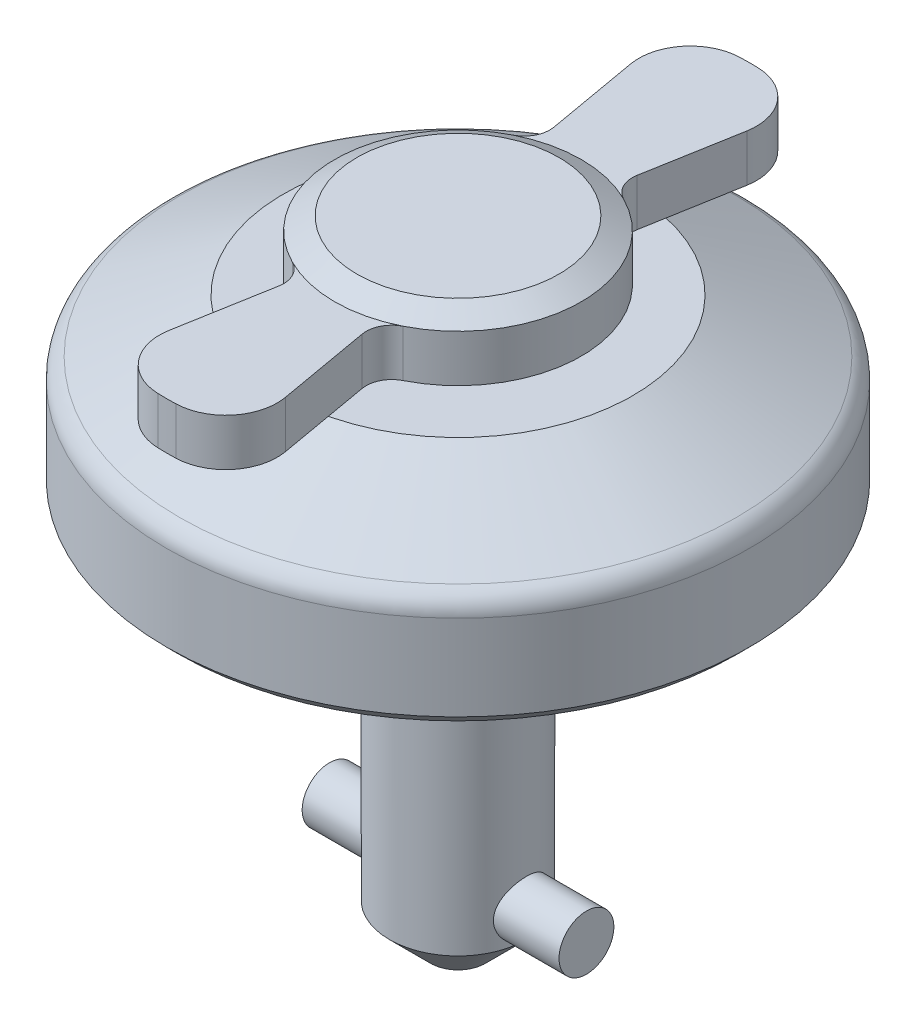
ISO-10303-21;
HEADER;
FILE_DESCRIPTION(('STEP AP214'),'2;1');
FILE_NAME('part.step','',(''),(''),'','','');
FILE_SCHEMA(('AUTOMOTIVE_DESIGN { 1 0 10303 214 1 1 1 1 }'));
ENDSEC;
DATA;
#1=APPLICATION_CONTEXT('core data for automotive mechanical design processes');
#2=APPLICATION_PROTOCOL_DEFINITION('international standard','automotive_design',2000,#1);
#3=PRODUCT_CONTEXT('',#1,'mechanical');
#4=PRODUCT('Part','Part','',(#3));
#5=PRODUCT_RELATED_PRODUCT_CATEGORY('part','',(#4));
#6=PRODUCT_DEFINITION_FORMATION('','',#4);
#7=PRODUCT_DEFINITION_CONTEXT('part definition',#1,'design');
#8=PRODUCT_DEFINITION('design','',#6,#7);
#9=PRODUCT_DEFINITION_SHAPE('','',#8);
#10=(LENGTH_UNIT() NAMED_UNIT(*) SI_UNIT(.MILLI.,.METRE.));
#11=(NAMED_UNIT(*) PLANE_ANGLE_UNIT() SI_UNIT($,.RADIAN.));
#12=(NAMED_UNIT(*) SI_UNIT($,.STERADIAN.) SOLID_ANGLE_UNIT());
#13=UNCERTAINTY_MEASURE_WITH_UNIT(LENGTH_MEASURE(1.E-05),#10,'distance_accuracy_value','');
#14=(GEOMETRIC_REPRESENTATION_CONTEXT(3) GLOBAL_UNCERTAINTY_ASSIGNED_CONTEXT((#13)) GLOBAL_UNIT_ASSIGNED_CONTEXT((#10,
#11,#12)) REPRESENTATION_CONTEXT('',''));
#15=CARTESIAN_POINT('',(0.,0.,0.));
#16=DIRECTION('',(0.,0.,1.));
#17=DIRECTION('',(1.,0.,0.));
#18=AXIS2_PLACEMENT_3D('',#15,#16,#17);
#19=CARTESIAN_POINT('',(0.,16.,0.));
#20=DIRECTION('',(0.,1.,0.));
#21=DIRECTION('',(0.,0.,1.));
#22=AXIS2_PLACEMENT_3D('',#19,#20,#21);
#23=CYLINDRICAL_SURFACE('',#22,7.2);
#24=CARTESIAN_POINT('',(0.,18.75,0.));
#25=DIRECTION('',(0.,1.,0.));
#26=DIRECTION('',(0.,0.,1.));
#27=AXIS2_PLACEMENT_3D('',#24,#25,#26);
#28=CIRCLE('',#27,7.2);
#29=CARTESIAN_POINT('',(-3.23506859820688,18.75,6.43228817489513));
#30=VERTEX_POINT('',#29);
#31=CARTESIAN_POINT('',(-3.23506859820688,18.75,-6.43228817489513));
#32=VERTEX_POINT('',#31);
#33=EDGE_CURVE('P0_E325',#30,#32,#28,.F.);
#34=ORIENTED_EDGE('',*,*,#33,.T.);
#35=DIRECTION('',(0.,1.,0.));
#36=VECTOR('',#35,1.);
#37=CARTESIAN_POINT('',(-3.23506859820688,16.,-6.43228817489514));
#38=LINE('',#37,#36);
#39=CARTESIAN_POINT('',(-3.23506859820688,16.,-6.43228817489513));
#40=VERTEX_POINT('',#39);
#41=EDGE_CURVE('P0_E242',#32,#40,#38,.F.);
#42=ORIENTED_EDGE('',*,*,#41,.T.);
#43=CARTESIAN_POINT('',(0.,16.,0.));
#44=DIRECTION('',(0.,1.,0.));
#45=DIRECTION('',(0.,0.,1.));
#46=AXIS2_PLACEMENT_3D('',#43,#44,#45);
#47=CIRCLE('',#46,7.2);
#48=CARTESIAN_POINT('',(-3.23506859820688,16.,6.43228817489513));
#49=VERTEX_POINT('',#48);
#50=EDGE_CURVE('P0_E222',#40,#49,#47,.T.);
#51=ORIENTED_EDGE('',*,*,#50,.T.);
#52=DIRECTION('',(0.,1.,0.));
#53=VECTOR('',#52,1.);
#54=CARTESIAN_POINT('',(-3.23506859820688,16.,6.43228817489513));
#55=LINE('',#54,#53);
#56=EDGE_CURVE('P0_E234',#49,#30,#55,.T.);
#57=ORIENTED_EDGE('',*,*,#56,.T.);
#58=EDGE_LOOP('',(#34,#42,#51,#57));
#59=FACE_BOUND('',#58,.T.);
#60=ADVANCED_FACE('P0_F16',(#59),#23,.T.);
#61=CARTESIAN_POINT('',(0.,-17.5,0.));
#62=DIRECTION('',(0.,-1.,0.));
#63=DIRECTION('',(0.,0.,-1.));
#64=AXIS2_PLACEMENT_3D('',#61,#62,#63);
#65=CYLINDRICAL_SURFACE('',#64,3.2);
#66=CARTESIAN_POINT('',(0.,0.,0.));
#67=DIRECTION('',(0.,-1.,0.));
#68=DIRECTION('',(0.,0.,-1.));
#69=AXIS2_PLACEMENT_3D('',#66,#67,#68);
#70=CIRCLE('',#69,3.2);
#71=CARTESIAN_POINT('',(0.,0.,-3.2));
#72=VERTEX_POINT('',#71);
#73=EDGE_CURVE('P0_E146',#72,#72,#70,.T.);
#74=ORIENTED_EDGE('',*,*,#73,.F.);
#75=EDGE_LOOP('',(#74));
#76=FACE_BOUND('',#75,.T.);
#77=CARTESIAN_POINT('',(0.,16.,0.));
#78=DIRECTION('',(0.,1.,0.));
#79=DIRECTION('',(0.,0.,1.));
#80=AXIS2_PLACEMENT_3D('',#77,#78,#79);
#81=CIRCLE('',#80,3.2);
#82=CARTESIAN_POINT('',(0.,16.,3.2));
#83=VERTEX_POINT('',#82);
#84=EDGE_CURVE('P0_E271',#83,#83,#81,.F.);
#85=ORIENTED_EDGE('',*,*,#84,.T.);
#86=EDGE_LOOP('',(#85));
#87=FACE_BOUND('',#86,.T.);
#88=ADVANCED_FACE('P0_F184',(#76,#87),#65,.T.);
#89=CARTESIAN_POINT('',(0.,-17.5,0.));
#90=DIRECTION('',(0.,-1.,0.));
#91=DIRECTION('',(0.,0.,-1.));
#92=AXIS2_PLACEMENT_3D('',#89,#90,#91);
#93=PLANE('',#92);
#94=CARTESIAN_POINT('',(0.,-17.5,0.));
#95=DIRECTION('',(0.,-1.,0.));
#96=DIRECTION('',(0.,0.,-1.));
#97=AXIS2_PLACEMENT_3D('',#94,#95,#96);
#98=CIRCLE('',#97,1.6);
#99=CARTESIAN_POINT('',(0.,-17.5,-1.6));
#100=VERTEX_POINT('',#99);
#101=EDGE_CURVE('P0_E137',#100,#100,#98,.T.);
#102=ORIENTED_EDGE('',*,*,#101,.T.);
#103=EDGE_LOOP('',(#102));
#104=FACE_BOUND('',#103,.T.);
#105=ADVANCED_FACE('P0_F186',(#104),#93,.T.);
#106=CARTESIAN_POINT('',(0.,-17.5,0.));
#107=DIRECTION('',(0.,1.,0.));
#108=DIRECTION('',(0.,0.,1.));
#109=AXIS2_PLACEMENT_3D('',#106,#107,#108);
#110=CONICAL_SURFACE('',#109,1.6,0.78539816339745);
#111=CARTESIAN_POINT('',(0.,-15.1,0.));
#112=DIRECTION('',(0.,-1.,0.));
#113=DIRECTION('',(0.,0.,-1.));
#114=AXIS2_PLACEMENT_3D('',#111,#112,#113);
#115=CIRCLE('',#114,4.);
#116=CARTESIAN_POINT('',(4.00000000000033,-15.1000000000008,0.));
#117=VERTEX_POINT('',#116);
#118=CARTESIAN_POINT('',(-4.,-15.1,0.));
#119=VERTEX_POINT('',#118);
#120=EDGE_CURVE('P0_E129',#117,#119,#115,.T.);
#121=ORIENTED_EDGE('',*,*,#120,.T.);
#122=EDGE_CURVE('P0_E133',#119,#117,#115,.T.);
#123=ORIENTED_EDGE('',*,*,#122,.T.);
#124=EDGE_LOOP('',(#121,#123));
#125=FACE_BOUND('',#124,.T.);
#126=ORIENTED_EDGE('',*,*,#101,.F.);
#127=EDGE_LOOP('',(#126));
#128=FACE_BOUND('',#127,.T.);
#129=ADVANCED_FACE('P0_F131',(#125,#128),#110,.T.);
#130=CARTESIAN_POINT('',(0.,-17.5,0.));
#131=DIRECTION('',(0.,-1.,0.));
#132=DIRECTION('',(0.,0.,-1.));
#133=AXIS2_PLACEMENT_3D('',#130,#131,#132);
#134=CYLINDRICAL_SURFACE('',#133,4.);
#135=CARTESIAN_POINT('',(0.,0.,0.));
#136=DIRECTION('',(0.,-1.,0.));
#137=DIRECTION('',(0.,0.,-1.));
#138=AXIS2_PLACEMENT_3D('',#135,#136,#137);
#139=CIRCLE('',#138,4.);
#140=CARTESIAN_POINT('',(0.,0.,-4.));
#141=VERTEX_POINT('',#140);
#142=EDGE_CURVE('P0_E144',#141,#141,#139,.T.);
#143=ORIENTED_EDGE('',*,*,#142,.T.);
#144=EDGE_LOOP('',(#143));
#145=FACE_BOUND('',#144,.T.);
#146=ORIENTED_EDGE('',*,*,#120,.F.);
#147=CARTESIAN_POINT('',(3.66606055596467,-13.5,1.6));
#148=CARTESIAN_POINT('',(3.66606921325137,-13.5857115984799,1.59999060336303));
#149=CARTESIAN_POINT('',(3.66910881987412,-13.6715444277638,1.59307185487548));
#150=CARTESIAN_POINT('',(3.68088731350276,-13.8407478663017,1.56565522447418));
#151=CARTESIAN_POINT('',(3.68964076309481,-13.9241116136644,1.5451226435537));
#152=CARTESIAN_POINT('',(3.71168364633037,-14.0856423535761,1.49138802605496));
#153=CARTESIAN_POINT('',(3.72495597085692,-14.1638276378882,1.45823372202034));
#154=CARTESIAN_POINT('',(3.75451732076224,-14.3135080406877,1.38033621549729));
#155=CARTESIAN_POINT('',(3.77080568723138,-14.3850046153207,1.335595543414));
#156=CARTESIAN_POINT('',(3.80560692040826,-14.5234083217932,1.23305757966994));
#157=CARTESIAN_POINT('',(3.82419134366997,-14.5898851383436,1.17470348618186));
#158=CARTESIAN_POINT('',(3.86089965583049,-14.7124231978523,1.04776728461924));
#159=CARTESIAN_POINT('',(3.87902338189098,-14.7684808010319,0.979181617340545));
#160=CARTESIAN_POINT('',(3.91362726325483,-14.8707251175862,0.830405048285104));
#161=CARTESIAN_POINT('',(3.93001442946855,-14.9164354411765,0.749863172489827));
#162=CARTESIAN_POINT('',(3.95843142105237,-14.9934748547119,0.581460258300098));
#163=CARTESIAN_POINT('',(3.97046301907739,-15.0248097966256,0.493602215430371));
#164=CARTESIAN_POINT('',(3.98830660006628,-15.0706731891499,0.317573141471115));
#165=CARTESIAN_POINT('',(3.99439149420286,-15.0859418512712,0.229623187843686));
#166=CARTESIAN_POINT('',(4.00064248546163,-15.1016227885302,0.0522130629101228));
#167=CARTESIAN_POINT('',(4.0008107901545,-15.1020406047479,-0.0372465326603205));
#168=CARTESIAN_POINT('',(3.99537570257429,-15.08841378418,-0.209785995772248));
#169=CARTESIAN_POINT('',(3.99009597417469,-15.0751801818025,-0.292941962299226));
#170=CARTESIAN_POINT('',(3.97479433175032,-15.0360056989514,-0.45573848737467));
#171=CARTESIAN_POINT('',(3.9647720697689,-15.0100638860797,-0.535378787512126));
#172=CARTESIAN_POINT('',(3.9407745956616,-14.945890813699,-0.690318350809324));
#173=CARTESIAN_POINT('',(3.9267420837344,-14.9074802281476,-0.765534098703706));
#174=CARTESIAN_POINT('',(3.89611668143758,-14.8196279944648,-0.908646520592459));
#175=CARTESIAN_POINT('',(3.87952291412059,-14.7701825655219,-0.976540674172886));
#176=CARTESIAN_POINT('',(3.84417309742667,-14.6578806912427,-1.10781506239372));
#177=CARTESIAN_POINT('',(3.82534661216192,-14.5943568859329,-1.17060627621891));
#178=CARTESIAN_POINT('',(3.78849328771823,-14.4576075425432,-1.28488593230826));
#179=CARTESIAN_POINT('',(3.77046671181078,-14.3843788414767,-1.33637067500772));
#180=CARTESIAN_POINT('',(3.7367751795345,-14.2276647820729,-1.42792335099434));
#181=CARTESIAN_POINT('',(3.72119131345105,-14.143948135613,-1.46762772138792));
#182=CARTESIAN_POINT('',(3.69510072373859,-13.9702276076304,-1.53214100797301));
#183=CARTESIAN_POINT('',(3.68459070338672,-13.8802278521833,-1.55695959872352));
#184=CARTESIAN_POINT('',(3.67063807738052,-13.7023713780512,-1.58956395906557));
#185=CARTESIAN_POINT('',(3.6668029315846,-13.6147196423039,-1.59829767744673));
#186=CARTESIAN_POINT('',(3.66551598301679,-13.4391382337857,-1.60124906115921));
#187=CARTESIAN_POINT('',(3.6680622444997,-13.3512086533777,-1.59547112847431));
#188=CARTESIAN_POINT('',(3.67884835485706,-13.1828328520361,-1.57042631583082));
#189=CARTESIAN_POINT('',(3.68675566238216,-13.1022456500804,-1.55194644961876));
#190=CARTESIAN_POINT('',(3.70696040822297,-12.9453692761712,-1.50304334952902));
#191=CARTESIAN_POINT('',(3.71925881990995,-12.8690810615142,-1.47261746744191));
#192=CARTESIAN_POINT('',(3.7474702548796,-12.7195181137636,-1.39930851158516));
#193=CARTESIAN_POINT('',(3.76350963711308,-12.6464910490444,-1.35597029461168));
#194=CARTESIAN_POINT('',(3.7972030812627,-12.5084136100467,-1.2585321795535));
#195=CARTESIAN_POINT('',(3.8148577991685,-12.4433665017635,-1.20442789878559));
#196=CARTESIAN_POINT('',(3.85136732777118,-12.3181012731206,-1.08227536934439));
#197=CARTESIAN_POINT('',(3.87021445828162,-12.2585947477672,-1.01349234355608));
#198=CARTESIAN_POINT('',(3.9057583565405,-12.1518583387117,-0.866466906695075));
#199=CARTESIAN_POINT('',(3.92245503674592,-12.1046289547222,-0.788224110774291));
#200=CARTESIAN_POINT('',(3.95186972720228,-12.023961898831,-0.624223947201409));
#201=CARTESIAN_POINT('',(3.96458868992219,-11.9905209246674,-0.538468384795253));
#202=CARTESIAN_POINT('',(3.98458170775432,-11.9387609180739,-0.36191487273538));
#203=CARTESIAN_POINT('',(3.99185871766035,-11.920433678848,-0.271119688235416));
#204=CARTESIAN_POINT('',(3.9998320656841,-11.9003962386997,-0.0934532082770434));
#205=CARTESIAN_POINT('',(4.00092677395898,-11.8976798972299,-0.00671239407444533));
#206=CARTESIAN_POINT('',(3.99748833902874,-11.9062843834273,0.165947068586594));
#207=CARTESIAN_POINT('',(3.9929560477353,-11.9176030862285,0.251865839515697));
#208=CARTESIAN_POINT('',(3.97897210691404,-11.9532374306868,0.417736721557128));
#209=CARTESIAN_POINT('',(3.96967584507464,-11.9771431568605,0.497791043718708));
#210=CARTESIAN_POINT('',(3.9471595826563,-12.0368422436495,0.652737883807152));
#211=CARTESIAN_POINT('',(3.93393885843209,-12.0726377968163,0.72762944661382));
#212=CARTESIAN_POINT('',(3.90414475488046,-12.1568825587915,0.873762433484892));
#213=CARTESIAN_POINT('',(3.88744903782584,-12.2058210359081,0.94469630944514));
#214=CARTESIAN_POINT('',(3.85271522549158,-12.3142308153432,1.07764322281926));
#215=CARTESIAN_POINT('',(3.834676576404,-12.3737064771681,1.1396525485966));
#216=CARTESIAN_POINT('',(3.79790210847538,-12.50585217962,1.25696101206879));
#217=CARTESIAN_POINT('',(3.77919226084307,-12.5791110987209,1.31160710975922));
#218=CARTESIAN_POINT('',(3.74439737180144,-12.734353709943,1.40787796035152));
#219=CARTESIAN_POINT('',(3.72831263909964,-12.8163384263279,1.44950118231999));
#220=CARTESIAN_POINT('',(3.70207091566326,-12.9792297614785,1.51519287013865));
#221=CARTESIAN_POINT('',(3.69151134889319,-13.059572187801,1.54050201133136));
#222=CARTESIAN_POINT('',(3.67556802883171,-13.2235883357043,1.57817420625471));
#223=CARTESIAN_POINT('',(3.6701698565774,-13.3072520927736,1.59057333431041));
#224=CARTESIAN_POINT('',(3.66659567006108,-13.4275020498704,1.59877140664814));
#225=CARTESIAN_POINT('',(3.66605689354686,-13.4637401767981,1.6000039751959));
#226=CARTESIAN_POINT('',(3.66606055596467,-13.5,1.6));
#227=B_SPLINE_CURVE_WITH_KNOTS('',3,(#147,#148,#149,#150,#151,#152,#153,#154,#155,#156,#157,
#158,#159,#160,#161,#162,#163,#164,#165,#166,#167,#168,#169,#170,#171,#172,#173,#174,#175,#176,
#177,#178,#179,#180,#181,#182,#183,#184,#185,#186,#187,#188,#189,#190,#191,#192,#193,#194,#195,
#196,#197,#198,#199,#200,#201,#202,#203,#204,#205,#206,#207,#208,#209,#210,#211,#212,#213,#214,
#215,#216,#217,#218,#219,#220,#221,#222,#223,#224,#225,#226),.UNSPECIFIED.,.T.,.F.,(4,2,2,2,2,2,
2,2,2,2,2,2,2,2,2,2,2,2,2,2,2,2,2,2,2,2,2,2,2,2,2,2,2,2,2,2,2,2,2,4),(0.,0.257022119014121,
0.514701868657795,0.771416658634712,1.02807543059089,1.2980449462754,1.56810859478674,
1.84882135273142,2.12941973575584,2.39643346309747,2.66334756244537,2.91526915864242,
3.16720924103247,3.42294640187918,3.67877131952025,3.95139235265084,4.22410245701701,
4.50451566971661,4.78474643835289,5.04785718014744,5.31088811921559,5.55893798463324,
5.80704286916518,6.06520923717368,6.32348091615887,6.60082987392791,6.87819011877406,
7.15548389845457,7.43262700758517,7.6916883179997,7.95071041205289,8.20177595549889,
8.45288782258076,8.71509640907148,8.97741373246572,9.25597002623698,9.53455905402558,
9.78813328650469,10.040997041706,10.1497288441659),.UNSPECIFIED.);
#228=EDGE_CURVE('P0_E143',#117,#117,#227,.T.);
#229=ORIENTED_EDGE('',*,*,#228,.F.);
#230=ORIENTED_EDGE('',*,*,#122,.F.);
#231=CARTESIAN_POINT('',(-3.66606055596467,-13.5,1.6));
#232=CARTESIAN_POINT('',(-3.66606921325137,-13.4142884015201,1.59999060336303));
#233=CARTESIAN_POINT('',(-3.66910881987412,-13.3284555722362,1.59307185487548));
#234=CARTESIAN_POINT('',(-3.68088731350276,-13.1592521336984,1.56565522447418));
#235=CARTESIAN_POINT('',(-3.68964076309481,-13.0758883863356,1.5451226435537));
#236=CARTESIAN_POINT('',(-3.71168364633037,-12.914357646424,1.49138802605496));
#237=CARTESIAN_POINT('',(-3.72495597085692,-12.8361723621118,1.45823372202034));
#238=CARTESIAN_POINT('',(-3.75451732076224,-12.6864919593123,1.38033621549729));
#239=CARTESIAN_POINT('',(-3.77080568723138,-12.6149953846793,1.335595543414));
#240=CARTESIAN_POINT('',(-3.80560692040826,-12.4765916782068,1.23305757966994));
#241=CARTESIAN_POINT('',(-3.82419134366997,-12.4101148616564,1.17470348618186));
#242=CARTESIAN_POINT('',(-3.86089965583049,-12.2875768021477,1.04776728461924));
#243=CARTESIAN_POINT('',(-3.87902338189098,-12.2315191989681,0.979181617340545));
#244=CARTESIAN_POINT('',(-3.91362726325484,-12.1292748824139,0.830405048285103));
#245=CARTESIAN_POINT('',(-3.93001442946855,-12.0835645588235,0.749863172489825));
#246=CARTESIAN_POINT('',(-3.95843142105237,-12.0065251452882,0.581460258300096));
#247=CARTESIAN_POINT('',(-3.97046301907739,-11.9751902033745,0.49360221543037));
#248=CARTESIAN_POINT('',(-3.98830660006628,-11.9293268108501,0.317573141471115));
#249=CARTESIAN_POINT('',(-3.99439149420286,-11.9140581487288,0.229623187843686));
#250=CARTESIAN_POINT('',(-4.00064248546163,-11.8983772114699,0.0522130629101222));
#251=CARTESIAN_POINT('',(-4.0008107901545,-11.8979593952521,-0.0372465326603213));
#252=CARTESIAN_POINT('',(-3.99537570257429,-11.91158621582,-0.209785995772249));
#253=CARTESIAN_POINT('',(-3.99009597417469,-11.9248198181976,-0.292941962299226));
#254=CARTESIAN_POINT('',(-3.97479433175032,-11.9639943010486,-0.45573848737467));
#255=CARTESIAN_POINT('',(-3.9647720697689,-11.9899361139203,-0.535378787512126));
#256=CARTESIAN_POINT('',(-3.9407745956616,-12.0541091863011,-0.690318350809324));
#257=CARTESIAN_POINT('',(-3.9267420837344,-12.0925197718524,-0.765534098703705));
#258=CARTESIAN_POINT('',(-3.89611668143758,-12.1803720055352,-0.908646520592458));
#259=CARTESIAN_POINT('',(-3.87952291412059,-12.2298174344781,-0.976540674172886));
#260=CARTESIAN_POINT('',(-3.84417309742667,-12.3421193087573,-1.10781506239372));
#261=CARTESIAN_POINT('',(-3.82534661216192,-12.4056431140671,-1.17060627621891));
#262=CARTESIAN_POINT('',(-3.78849328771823,-12.5423924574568,-1.28488593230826));
#263=CARTESIAN_POINT('',(-3.77046671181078,-12.6156211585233,-1.33637067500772));
#264=CARTESIAN_POINT('',(-3.7367751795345,-12.7723352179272,-1.42792335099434));
#265=CARTESIAN_POINT('',(-3.72119131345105,-12.8560518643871,-1.46762772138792));
#266=CARTESIAN_POINT('',(-3.69510072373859,-13.0297723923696,-1.53214100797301));
#267=CARTESIAN_POINT('',(-3.68459070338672,-13.1197721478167,-1.55695959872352));
#268=CARTESIAN_POINT('',(-3.67063807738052,-13.2976286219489,-1.58956395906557));
#269=CARTESIAN_POINT('',(-3.6668029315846,-13.3852803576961,-1.59829767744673));
#270=CARTESIAN_POINT('',(-3.66551598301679,-13.5608617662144,-1.60124906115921));
#271=CARTESIAN_POINT('',(-3.6680622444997,-13.6487913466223,-1.59547112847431));
#272=CARTESIAN_POINT('',(-3.67884835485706,-13.8171671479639,-1.57042631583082));
#273=CARTESIAN_POINT('',(-3.68675566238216,-13.8977543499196,-1.55194644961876));
#274=CARTESIAN_POINT('',(-3.70696040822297,-14.0546307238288,-1.50304334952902));
#275=CARTESIAN_POINT('',(-3.71925881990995,-14.1309189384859,-1.47261746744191));
#276=CARTESIAN_POINT('',(-3.7474702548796,-14.2804818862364,-1.39930851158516));
#277=CARTESIAN_POINT('',(-3.76350963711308,-14.3535089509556,-1.35597029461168));
#278=CARTESIAN_POINT('',(-3.7972030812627,-14.4915863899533,-1.2585321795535));
#279=CARTESIAN_POINT('',(-3.8148577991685,-14.5566334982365,-1.20442789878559));
#280=CARTESIAN_POINT('',(-3.85136732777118,-14.6818987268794,-1.08227536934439));
#281=CARTESIAN_POINT('',(-3.87021445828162,-14.7414052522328,-1.01349234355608));
#282=CARTESIAN_POINT('',(-3.9057583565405,-14.8481416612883,-0.866466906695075));
#283=CARTESIAN_POINT('',(-3.92245503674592,-14.8953710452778,-0.788224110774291));
#284=CARTESIAN_POINT('',(-3.95186972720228,-14.976038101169,-0.624223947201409));
#285=CARTESIAN_POINT('',(-3.96458868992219,-15.0094790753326,-0.538468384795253));
#286=CARTESIAN_POINT('',(-3.98458170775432,-15.0612390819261,-0.361914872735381));
#287=CARTESIAN_POINT('',(-3.99185871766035,-15.0795663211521,-0.271119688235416));
#288=CARTESIAN_POINT('',(-3.9998320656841,-15.0996037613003,-0.093453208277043));
#289=CARTESIAN_POINT('',(-4.00092677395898,-15.1023201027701,-0.0067123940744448));
#290=CARTESIAN_POINT('',(-3.99748833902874,-15.0937156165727,0.165947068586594));
#291=CARTESIAN_POINT('',(-3.9929560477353,-15.0823969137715,0.251865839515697));
#292=CARTESIAN_POINT('',(-3.97897210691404,-15.0467625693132,0.417736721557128));
#293=CARTESIAN_POINT('',(-3.96967584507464,-15.0228568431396,0.497791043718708));
#294=CARTESIAN_POINT('',(-3.9471595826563,-14.9631577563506,0.652737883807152));
#295=CARTESIAN_POINT('',(-3.93393885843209,-14.9273622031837,0.72762944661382));
#296=CARTESIAN_POINT('',(-3.90414475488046,-14.8431174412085,0.873762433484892));
#297=CARTESIAN_POINT('',(-3.88744903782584,-14.7941789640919,0.94469630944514));
#298=CARTESIAN_POINT('',(-3.85271522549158,-14.6857691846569,1.07764322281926));
#299=CARTESIAN_POINT('',(-3.834676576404,-14.6262935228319,1.1396525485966));
#300=CARTESIAN_POINT('',(-3.79790210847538,-14.49414782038,1.25696101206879));
#301=CARTESIAN_POINT('',(-3.77919226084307,-14.4208889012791,1.31160710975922));
#302=CARTESIAN_POINT('',(-3.74439737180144,-14.265646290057,1.40787796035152));
#303=CARTESIAN_POINT('',(-3.72831263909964,-14.1836615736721,1.44950118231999));
#304=CARTESIAN_POINT('',(-3.70207091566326,-14.0207702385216,1.51519287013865));
#305=CARTESIAN_POINT('',(-3.69151134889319,-13.9404278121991,1.54050201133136));
#306=CARTESIAN_POINT('',(-3.67556802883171,-13.7764116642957,1.57817420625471));
#307=CARTESIAN_POINT('',(-3.6701698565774,-13.6927479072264,1.59057333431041));
#308=CARTESIAN_POINT('',(-3.66659567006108,-13.5724979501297,1.59877140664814));
#309=CARTESIAN_POINT('',(-3.66605689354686,-13.5362598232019,1.6000039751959));
#310=CARTESIAN_POINT('',(-3.66606055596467,-13.5,1.6));
#311=B_SPLINE_CURVE_WITH_KNOTS('',3,(#231,#232,#233,#234,#235,#236,#237,#238,#239,#240,#241,
#242,#243,#244,#245,#246,#247,#248,#249,#250,#251,#252,#253,#254,#255,#256,#257,#258,#259,#260,
#261,#262,#263,#264,#265,#266,#267,#268,#269,#270,#271,#272,#273,#274,#275,#276,#277,#278,#279,
#280,#281,#282,#283,#284,#285,#286,#287,#288,#289,#290,#291,#292,#293,#294,#295,#296,#297,#298,
#299,#300,#301,#302,#303,#304,#305,#306,#307,#308,#309,#310),.UNSPECIFIED.,.T.,.F.,(4,2,2,2,2,2,
2,2,2,2,2,2,2,2,2,2,2,2,2,2,2,2,2,2,2,2,2,2,2,2,2,2,2,2,2,2,2,2,2,4),(0.,0.257022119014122,
0.514701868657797,0.771416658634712,1.02807543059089,1.2980449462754,1.56810859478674,
1.84882135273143,2.12941973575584,2.39643346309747,2.66334756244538,2.91526915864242,
3.16720924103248,3.42294640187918,3.67877131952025,3.95139235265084,4.22410245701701,
4.50451566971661,4.78474643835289,5.04785718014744,5.31088811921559,5.55893798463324,
5.80704286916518,6.06520923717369,6.32348091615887,6.60082987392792,6.87819011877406,
7.15548389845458,7.43262700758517,7.6916883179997,7.95071041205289,8.2017759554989,
8.45288782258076,8.71509640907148,8.97741373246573,9.25597002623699,9.53455905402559,
9.78813328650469,10.040997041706,10.1497288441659),.UNSPECIFIED.);
#312=EDGE_CURVE('P0_E141',#119,#119,#311,.T.);
#313=ORIENTED_EDGE('',*,*,#312,.F.);
#314=EDGE_LOOP('',(#146,#229,#230,#313));
#315=FACE_BOUND('',#314,.T.);
#316=ADVANCED_FACE('P0_F139',(#145,#315),#134,.T.);
#317=CARTESIAN_POINT('',(4.,0.,0.));
#318=DIRECTION('',(0.,1.,0.));
#319=DIRECTION('',(0.,0.,1.));
#320=AXIS2_PLACEMENT_3D('',#317,#318,#319);
#321=PLANE('',#320);
#322=ORIENTED_EDGE('',*,*,#73,.T.);
#323=EDGE_LOOP('',(#322));
#324=FACE_BOUND('',#323,.T.);
#325=ORIENTED_EDGE('',*,*,#142,.F.);
#326=EDGE_LOOP('',(#325));
#327=FACE_BOUND('',#326,.T.);
#328=ADVANCED_FACE('P0_F176',(#324,#327),#321,.T.);
#329=CARTESIAN_POINT('',(-7.5,-13.5,0.));
#330=DIRECTION('',(-1.,0.,0.));
#331=DIRECTION('',(0.,0.,1.));
#332=AXIS2_PLACEMENT_3D('',#329,#330,#331);
#333=PLANE('',#332);
#334=CARTESIAN_POINT('',(-7.5,-13.5,0.));
#335=DIRECTION('',(-1.,0.,0.));
#336=DIRECTION('',(0.,0.,1.));
#337=AXIS2_PLACEMENT_3D('',#334,#335,#336);
#338=CIRCLE('',#337,1.6);
#339=CARTESIAN_POINT('',(-7.5,-13.5,1.6));
#340=VERTEX_POINT('',#339);
#341=EDGE_CURVE('P0_E315',#340,#340,#338,.T.);
#342=ORIENTED_EDGE('',*,*,#341,.T.);
#343=EDGE_LOOP('',(#342));
#344=FACE_BOUND('',#343,.T.);
#345=ADVANCED_FACE('P0_F169',(#344),#333,.T.);
#346=CARTESIAN_POINT('',(-5.26029262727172,-13.5,0.));
#347=DIRECTION('',(-1.,0.,0.));
#348=DIRECTION('',(0.,0.,1.));
#349=AXIS2_PLACEMENT_3D('',#346,#347,#348);
#350=CYLINDRICAL_SURFACE('',#349,1.6);
#351=ORIENTED_EDGE('',*,*,#312,.T.);
#352=EDGE_LOOP('',(#351));
#353=FACE_BOUND('',#352,.T.);
#354=ORIENTED_EDGE('',*,*,#341,.F.);
#355=EDGE_LOOP('',(#354));
#356=FACE_BOUND('',#355,.T.);
#357=ADVANCED_FACE('P0_F163',(#353,#356),#350,.T.);
#358=ORIENTED_EDGE('',*,*,#228,.T.);
#359=EDGE_LOOP('',(#358));
#360=FACE_BOUND('',#359,.T.);
#361=CARTESIAN_POINT('',(7.5,-13.5,0.));
#362=DIRECTION('',(-1.,0.,0.));
#363=DIRECTION('',(0.,0.,1.));
#364=AXIS2_PLACEMENT_3D('',#361,#362,#363);
#365=CIRCLE('',#364,1.6);
#366=CARTESIAN_POINT('',(7.5,-13.5,1.6));
#367=VERTEX_POINT('',#366);
#368=EDGE_CURVE('P0_E312',#367,#367,#365,.T.);
#369=ORIENTED_EDGE('',*,*,#368,.T.);
#370=EDGE_LOOP('',(#369));
#371=FACE_BOUND('',#370,.T.);
#372=ADVANCED_FACE('P0_F168',(#360,#371),#350,.T.);
#373=CARTESIAN_POINT('',(7.5,-15.1,0.));
#374=DIRECTION('',(1.,0.,0.));
#375=DIRECTION('',(0.,0.,-1.));
#376=AXIS2_PLACEMENT_3D('',#373,#374,#375);
#377=PLANE('',#376);
#378=ORIENTED_EDGE('',*,*,#368,.F.);
#379=EDGE_LOOP('',(#378));
#380=FACE_BOUND('',#379,.T.);
#381=ADVANCED_FACE('P0_F171',(#380),#377,.T.);
#382=CARTESIAN_POINT('',(3.23506859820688,16.,6.43228817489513));
#383=VERTEX_POINT('',#382);
#384=CARTESIAN_POINT('',(3.23506859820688,16.,-6.43228817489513));
#385=VERTEX_POINT('',#384);
#386=EDGE_CURVE('P0_E215',#383,#385,#47,.T.);
#387=ORIENTED_EDGE('',*,*,#386,.T.);
#388=DIRECTION('',(0.,1.,0.));
#389=VECTOR('',#388,1.);
#390=CARTESIAN_POINT('',(3.23506859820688,16.,-6.43228817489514));
#391=LINE('',#390,#389);
#392=CARTESIAN_POINT('',(3.23506859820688,18.75,-6.43228817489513));
#393=VERTEX_POINT('',#392);
#394=EDGE_CURVE('P0_E218',#385,#393,#391,.T.);
#395=ORIENTED_EDGE('',*,*,#394,.T.);
#396=CARTESIAN_POINT('',(3.23506859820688,18.75,6.43228817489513));
#397=VERTEX_POINT('',#396);
#398=EDGE_CURVE('P0_E328',#393,#397,#28,.F.);
#399=ORIENTED_EDGE('',*,*,#398,.T.);
#400=DIRECTION('',(0.,1.,0.));
#401=VECTOR('',#400,1.);
#402=CARTESIAN_POINT('',(3.23506859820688,16.,6.43228817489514));
#403=LINE('',#402,#401);
#404=EDGE_CURVE('P0_E220',#397,#383,#403,.F.);
#405=ORIENTED_EDGE('',*,*,#404,.T.);
#406=EDGE_LOOP('',(#387,#395,#399,#405));
#407=FACE_BOUND('',#406,.T.);
#408=ADVANCED_FACE('P0_F199',(#407),#23,.T.);
#409=CARTESIAN_POINT('',(0.,16.,0.));
#410=DIRECTION('',(0.,1.,0.));
#411=DIRECTION('',(0.,0.,1.));
#412=AXIS2_PLACEMENT_3D('',#409,#410,#411);
#413=PLANE('',#412);
#414=ORIENTED_EDGE('',*,*,#84,.F.);
#415=EDGE_LOOP('',(#414));
#416=FACE_BOUND('',#415,.T.);
#417=CARTESIAN_POINT('',(0.,16.,0.));
#418=DIRECTION('',(0.,-1.,0.));
#419=DIRECTION('',(0.,0.,-1.));
#420=AXIS2_PLACEMENT_3D('',#417,#418,#419);
#421=CIRCLE('',#420,17.);
#422=CARTESIAN_POINT('',(-0.530065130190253,16.,-16.9917341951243));
#423=VERTEX_POINT('',#422);
#424=CARTESIAN_POINT('',(0.530065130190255,16.,-16.9917341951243));
#425=VERTEX_POINT('',#424);
#426=EDGE_CURVE('P0_E309',#423,#425,#421,.T.);
#427=ORIENTED_EDGE('',*,*,#426,.T.);
#428=CARTESIAN_POINT('',(0.436524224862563,16.,-13.993192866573));
#429=DIRECTION('',(0.,1.,0.));
#430=DIRECTION('',(0.,0.,1.));
#431=AXIS2_PLACEMENT_3D('',#428,#429,#430);
#432=CIRCLE('',#431,3.);
#433=CARTESIAN_POINT('',(3.39094748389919,16.,-13.4722483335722));
#434=VERTEX_POINT('',#433);
#435=EDGE_CURVE('P0_E339',#425,#434,#432,.F.);
#436=ORIENTED_EDGE('',*,*,#435,.T.);
#437=DIRECTION('',(0.173648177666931,0.,-0.984807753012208));
#438=VECTOR('',#437,1.);
#439=CARTESIAN_POINT('',(5.92038481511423,16.,-27.8174002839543));
#440=LINE('',#439,#438);
#441=CARTESIAN_POINT('',(2.431829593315,16.,-8.03282047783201));
#442=VERTEX_POINT('',#441);
#443=EDGE_CURVE('P0_E304',#442,#434,#440,.T.);
#444=ORIENTED_EDGE('',*,*,#443,.F.);
#445=CARTESIAN_POINT('',(3.90904122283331,16.,-7.77234821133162));
#446=DIRECTION('',(0.,1.,0.));
#447=DIRECTION('',(0.,0.,1.));
#448=AXIS2_PLACEMENT_3D('',#445,#446,#447);
#449=CIRCLE('',#448,1.5);
#450=EDGE_CURVE('P0_E229',#442,#385,#449,.T.);
#451=ORIENTED_EDGE('',*,*,#450,.T.);
#452=ORIENTED_EDGE('',*,*,#386,.F.);
#453=CARTESIAN_POINT('',(3.90904122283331,16.,7.77234821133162));
#454=DIRECTION('',(0.,1.,0.));
#455=DIRECTION('',(0.,0.,1.));
#456=AXIS2_PLACEMENT_3D('',#453,#454,#455);
#457=CIRCLE('',#456,1.5);
#458=CARTESIAN_POINT('',(2.431829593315,16.,8.03282047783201));
#459=VERTEX_POINT('',#458);
#460=EDGE_CURVE('P0_E252',#383,#459,#457,.T.);
#461=ORIENTED_EDGE('',*,*,#460,.T.);
#462=DIRECTION('',(0.173648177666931,0.,0.984807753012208));
#463=VECTOR('',#462,1.);
#464=CARTESIAN_POINT('',(-3.95076930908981,16.,-28.1646966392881));
#465=LINE('',#464,#463);
#466=CARTESIAN_POINT('',(3.39094748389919,16.,13.4722483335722));
#467=VERTEX_POINT('',#466);
#468=EDGE_CURVE('P0_E295',#459,#467,#465,.T.);
#469=ORIENTED_EDGE('',*,*,#468,.T.);
#470=CARTESIAN_POINT('',(0.436524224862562,16.,13.993192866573));
#471=DIRECTION('',(0.,1.,0.));
#472=DIRECTION('',(0.,0.,1.));
#473=AXIS2_PLACEMENT_3D('',#470,#471,#472);
#474=CIRCLE('',#473,3.);
#475=CARTESIAN_POINT('',(0.530065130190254,16.,16.9917341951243));
#476=VERTEX_POINT('',#475);
#477=EDGE_CURVE('P0_E337',#467,#476,#474,.F.);
#478=ORIENTED_EDGE('',*,*,#477,.T.);
#479=CARTESIAN_POINT('',(0.,16.,0.));
#480=DIRECTION('',(0.,-1.,0.));
#481=DIRECTION('',(0.,0.,-1.));
#482=AXIS2_PLACEMENT_3D('',#479,#480,#481);
#483=CIRCLE('',#482,17.);
#484=CARTESIAN_POINT('',(-0.53006513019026,16.,16.9917341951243));
#485=VERTEX_POINT('',#484);
#486=EDGE_CURVE('P0_E297',#476,#485,#483,.T.);
#487=ORIENTED_EDGE('',*,*,#486,.T.);
#488=CARTESIAN_POINT('',(-0.436524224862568,16.,13.993192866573));
#489=DIRECTION('',(0.,1.,0.));
#490=DIRECTION('',(0.,0.,1.));
#491=AXIS2_PLACEMENT_3D('',#488,#489,#490);
#492=CIRCLE('',#491,3.);
#493=CARTESIAN_POINT('',(-3.39094748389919,16.,13.4722483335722));
#494=VERTEX_POINT('',#493);
#495=EDGE_CURVE('P0_E335',#485,#494,#492,.F.);
#496=ORIENTED_EDGE('',*,*,#495,.T.);
#497=DIRECTION('',(-0.173648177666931,0.,0.984807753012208));
#498=VECTOR('',#497,1.);
#499=CARTESIAN_POINT('',(3.95076930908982,16.,-28.1646966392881));
#500=LINE('',#499,#498);
#501=CARTESIAN_POINT('',(-2.431829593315,16.,8.03282047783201));
#502=VERTEX_POINT('',#501);
#503=EDGE_CURVE('P0_E266',#502,#494,#500,.T.);
#504=ORIENTED_EDGE('',*,*,#503,.F.);
#505=CARTESIAN_POINT('',(-3.90904122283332,16.,7.77234821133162));
#506=DIRECTION('',(0.,1.,0.));
#507=DIRECTION('',(0.,0.,1.));
#508=AXIS2_PLACEMENT_3D('',#505,#506,#507);
#509=CIRCLE('',#508,1.5);
#510=EDGE_CURVE('P0_E25',#502,#49,#509,.T.);
#511=ORIENTED_EDGE('',*,*,#510,.T.);
#512=ORIENTED_EDGE('',*,*,#50,.F.);
#513=CARTESIAN_POINT('',(-3.90904122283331,16.,-7.77234821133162));
#514=DIRECTION('',(0.,1.,0.));
#515=DIRECTION('',(0.,0.,1.));
#516=AXIS2_PLACEMENT_3D('',#513,#514,#515);
#517=CIRCLE('',#516,1.5);
#518=CARTESIAN_POINT('',(-2.431829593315,16.,-8.03282047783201));
#519=VERTEX_POINT('',#518);
#520=EDGE_CURVE('P0_E257',#40,#519,#517,.T.);
#521=ORIENTED_EDGE('',*,*,#520,.T.);
#522=DIRECTION('',(-0.173648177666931,0.,-0.984807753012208));
#523=VECTOR('',#522,1.);
#524=CARTESIAN_POINT('',(-5.92038481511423,16.,-27.8174002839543));
#525=LINE('',#524,#523);
#526=CARTESIAN_POINT('',(-3.39094748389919,16.,-13.4722483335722));
#527=VERTEX_POINT('',#526);
#528=EDGE_CURVE('P0_E288',#519,#527,#525,.T.);
#529=ORIENTED_EDGE('',*,*,#528,.T.);
#530=CARTESIAN_POINT('',(-0.436524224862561,16.,-13.993192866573));
#531=DIRECTION('',(0.,1.,0.));
#532=DIRECTION('',(0.,0.,1.));
#533=AXIS2_PLACEMENT_3D('',#530,#531,#532);
#534=CIRCLE('',#533,3.);
#535=EDGE_CURVE('P0_E333',#527,#423,#534,.F.);
#536=ORIENTED_EDGE('',*,*,#535,.T.);
#537=EDGE_LOOP('',(#427,#436,#444,#451,#452,#461,#469,#478,#487,#496,#504,#511,#512,#521,#529,#536));
#538=FACE_BOUND('',#537,.T.);
#539=ADVANCED_FACE('P0_F182',(#416,#538),#413,.F.);
#540=CARTESIAN_POINT('',(2.4,19.5,0.));
#541=DIRECTION('',(0.,1.,0.));
#542=DIRECTION('',(0.,0.,1.));
#543=AXIS2_PLACEMENT_3D('',#540,#541,#542);
#544=PLANE('',#543);
#545=CARTESIAN_POINT('',(0.,19.5,0.));
#546=DIRECTION('',(0.,1.,0.));
#547=DIRECTION('',(0.,0.,1.));
#548=AXIS2_PLACEMENT_3D('',#545,#546,#547);
#549=CIRCLE('',#548,5.90096189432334);
#550=CARTESIAN_POINT('',(0.,19.5,5.90096189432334));
#551=VERTEX_POINT('',#550);
#552=EDGE_CURVE('P0_E322',#551,#551,#549,.T.);
#553=ORIENTED_EDGE('',*,*,#552,.T.);
#554=EDGE_LOOP('',(#553));
#555=FACE_BOUND('',#554,.T.);
#556=ADVANCED_FACE('P0_F178',(#555),#544,.T.);
#557=CARTESIAN_POINT('',(0.,19.5,0.));
#558=DIRECTION('',(0.,-1.,0.));
#559=DIRECTION('',(0.,0.,-1.));
#560=AXIS2_PLACEMENT_3D('',#557,#558,#559);
#561=CONICAL_SURFACE('',#560,5.90096189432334,1.0471975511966);
#562=EDGE_CURVE('P0_E32',#32,#393,#28,.F.);
#563=ORIENTED_EDGE('',*,*,#562,.F.);
#564=ORIENTED_EDGE('',*,*,#33,.F.);
#565=CARTESIAN_POINT('',(0.,18.75,0.));
#566=DIRECTION('',(0.,-1.,0.));
#567=DIRECTION('',(0.,0.,-1.));
#568=AXIS2_PLACEMENT_3D('',#565,#566,#567);
#569=CIRCLE('',#568,7.2);
#570=EDGE_CURVE('P0_E280',#397,#30,#569,.T.);
#571=ORIENTED_EDGE('',*,*,#570,.F.);
#572=ORIENTED_EDGE('',*,*,#398,.F.);
#573=EDGE_LOOP('',(#563,#564,#571,#572));
#574=FACE_BOUND('',#573,.T.);
#575=ORIENTED_EDGE('',*,*,#552,.F.);
#576=EDGE_LOOP('',(#575));
#577=FACE_BOUND('',#576,.T.);
#578=ADVANCED_FACE('P0_F181',(#574,#577),#561,.T.);
#579=CARTESIAN_POINT('',(-5.92038481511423,18.75,-27.8174002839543));
#580=DIRECTION('',(-0.984807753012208,0.,0.173648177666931));
#581=DIRECTION('',(0.173648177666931,0.,0.984807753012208));
#582=AXIS2_PLACEMENT_3D('',#579,#580,#581);
#583=PLANE('',#582);
#584=ORIENTED_EDGE('',*,*,#528,.F.);
#585=DIRECTION('',(0.,-1.,0.));
#586=VECTOR('',#585,1.);
#587=CARTESIAN_POINT('',(-2.431829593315,18.75,-8.03282047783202));
#588=LINE('',#587,#586);
#589=CARTESIAN_POINT('',(-2.431829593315,18.75,-8.03282047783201));
#590=VERTEX_POINT('',#589);
#591=EDGE_CURVE('P0_E245',#519,#590,#588,.F.);
#592=ORIENTED_EDGE('',*,*,#591,.T.);
#593=DIRECTION('',(-0.173648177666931,0.,-0.984807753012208));
#594=VECTOR('',#593,1.);
#595=CARTESIAN_POINT('',(-5.92038481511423,18.75,-27.8174002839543));
#596=LINE('',#595,#594);
#597=CARTESIAN_POINT('',(-3.39094748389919,18.75,-13.4722483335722));
#598=VERTEX_POINT('',#597);
#599=EDGE_CURVE('P0_E301',#590,#598,#596,.T.);
#600=ORIENTED_EDGE('',*,*,#599,.T.);
#601=DIRECTION('',(0.,-1.,0.));
#602=VECTOR('',#601,1.);
#603=CARTESIAN_POINT('',(-3.39094748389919,18.75,-13.4722483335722));
#604=LINE('',#603,#602);
#605=EDGE_CURVE('P0_E364',#598,#527,#604,.T.);
#606=ORIENTED_EDGE('',*,*,#605,.T.);
#607=EDGE_LOOP('',(#584,#592,#600,#606));
#608=FACE_BOUND('',#607,.T.);
#609=ADVANCED_FACE('P0_F394',(#608),#583,.T.);
#610=CARTESIAN_POINT('',(5.92038481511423,18.75,-27.8174002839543));
#611=DIRECTION('',(-0.984807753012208,0.,-0.173648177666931));
#612=DIRECTION('',(-0.173648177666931,0.,0.984807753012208));
#613=AXIS2_PLACEMENT_3D('',#610,#611,#612);
#614=PLANE('',#613);
#615=DIRECTION('',(0.173648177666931,0.,-0.984807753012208));
#616=VECTOR('',#615,1.);
#617=CARTESIAN_POINT('',(5.92038481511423,18.75,-27.8174002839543));
#618=LINE('',#617,#616);
#619=CARTESIAN_POINT('',(2.431829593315,18.75,-8.03282047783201));
#620=VERTEX_POINT('',#619);
#621=CARTESIAN_POINT('',(3.39094748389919,18.75,-13.4722483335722));
#622=VERTEX_POINT('',#621);
#623=EDGE_CURVE('P0_E223',#620,#622,#618,.T.);
#624=ORIENTED_EDGE('',*,*,#623,.F.);
#625=DIRECTION('',(0.,1.,0.));
#626=VECTOR('',#625,1.);
#627=CARTESIAN_POINT('',(2.431829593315,18.75,-8.03282047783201));
#628=LINE('',#627,#626);
#629=EDGE_CURVE('P0_E236',#620,#442,#628,.F.);
#630=ORIENTED_EDGE('',*,*,#629,.T.);
#631=ORIENTED_EDGE('',*,*,#443,.T.);
#632=DIRECTION('',(0.,1.,0.));
#633=VECTOR('',#632,1.);
#634=CARTESIAN_POINT('',(3.39094748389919,18.75,-13.4722483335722));
#635=LINE('',#634,#633);
#636=EDGE_CURVE('P0_E342',#434,#622,#635,.T.);
#637=ORIENTED_EDGE('',*,*,#636,.T.);
#638=EDGE_LOOP('',(#624,#630,#631,#637));
#639=FACE_BOUND('',#638,.T.);
#640=ADVANCED_FACE('P0_F369',(#639),#614,.F.);
#641=CARTESIAN_POINT('',(0.,18.75,0.));
#642=DIRECTION('',(0.,-1.,0.));
#643=DIRECTION('',(0.,0.,-1.));
#644=AXIS2_PLACEMENT_3D('',#641,#642,#643);
#645=CYLINDRICAL_SURFACE('',#644,17.);
#646=CARTESIAN_POINT('',(0.,18.75,0.));
#647=DIRECTION('',(0.,-1.,0.));
#648=DIRECTION('',(0.,0.,-1.));
#649=AXIS2_PLACEMENT_3D('',#646,#647,#648);
#650=CIRCLE('',#649,17.);
#651=CARTESIAN_POINT('',(-0.530065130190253,18.75,-16.9917341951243));
#652=VERTEX_POINT('',#651);
#653=CARTESIAN_POINT('',(0.530065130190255,18.75,-16.9917341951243));
#654=VERTEX_POINT('',#653);
#655=EDGE_CURVE('P0_E303',#652,#654,#650,.T.);
#656=ORIENTED_EDGE('',*,*,#655,.T.);
#657=DIRECTION('',(0.,-1.,0.));
#658=VECTOR('',#657,1.);
#659=CARTESIAN_POINT('',(0.530065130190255,18.75,-16.9917341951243));
#660=LINE('',#659,#658);
#661=EDGE_CURVE('P0_E330',#654,#425,#660,.T.);
#662=ORIENTED_EDGE('',*,*,#661,.T.);
#663=ORIENTED_EDGE('',*,*,#426,.F.);
#664=DIRECTION('',(0.,-1.,0.));
#665=VECTOR('',#664,1.);
#666=CARTESIAN_POINT('',(-0.530065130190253,18.75,-16.9917341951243));
#667=LINE('',#666,#665);
#668=EDGE_CURVE('P0_E327',#423,#652,#667,.F.);
#669=ORIENTED_EDGE('',*,*,#668,.T.);
#670=EDGE_LOOP('',(#656,#662,#663,#669));
#671=FACE_BOUND('',#670,.T.);
#672=ADVANCED_FACE('P0_F381',(#671),#645,.T.);
#673=CARTESIAN_POINT('',(0.,18.75,-28.8613238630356));
#674=DIRECTION('',(0.,-1.,0.));
#675=DIRECTION('',(0.,0.,-1.));
#676=AXIS2_PLACEMENT_3D('',#673,#674,#675);
#677=PLANE('',#676);
#678=ORIENTED_EDGE('',*,*,#562,.T.);
#679=CARTESIAN_POINT('',(3.90904122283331,18.75,-7.77234821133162));
#680=DIRECTION('',(0.,-1.,0.));
#681=DIRECTION('',(0.,0.,-1.));
#682=AXIS2_PLACEMENT_3D('',#679,#680,#681);
#683=CIRCLE('',#682,1.5);
#684=EDGE_CURVE('P0_E231',#393,#620,#683,.T.);
#685=ORIENTED_EDGE('',*,*,#684,.T.);
#686=ORIENTED_EDGE('',*,*,#623,.T.);
#687=CARTESIAN_POINT('',(0.436524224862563,18.75,-13.993192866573));
#688=DIRECTION('',(0.,-1.,0.));
#689=DIRECTION('',(0.,0.,-1.));
#690=AXIS2_PLACEMENT_3D('',#687,#688,#689);
#691=CIRCLE('',#690,3.);
#692=EDGE_CURVE('P0_E348',#622,#654,#691,.F.);
#693=ORIENTED_EDGE('',*,*,#692,.T.);
#694=ORIENTED_EDGE('',*,*,#655,.F.);
#695=CARTESIAN_POINT('',(-0.436524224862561,18.75,-13.993192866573));
#696=DIRECTION('',(0.,-1.,0.));
#697=DIRECTION('',(0.,0.,-1.));
#698=AXIS2_PLACEMENT_3D('',#695,#696,#697);
#699=CIRCLE('',#698,3.);
#700=EDGE_CURVE('P0_E345',#652,#598,#699,.F.);
#701=ORIENTED_EDGE('',*,*,#700,.T.);
#702=ORIENTED_EDGE('',*,*,#599,.F.);
#703=CARTESIAN_POINT('',(-3.90904122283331,18.75,-7.77234821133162));
#704=DIRECTION('',(0.,-1.,0.));
#705=DIRECTION('',(0.,0.,-1.));
#706=AXIS2_PLACEMENT_3D('',#703,#704,#705);
#707=CIRCLE('',#706,1.5);
#708=EDGE_CURVE('P0_E259',#590,#32,#707,.T.);
#709=ORIENTED_EDGE('',*,*,#708,.T.);
#710=EDGE_LOOP('',(#678,#685,#686,#693,#694,#701,#702,#709));
#711=FACE_BOUND('',#710,.T.);
#712=ADVANCED_FACE('P0_F378',(#711),#677,.F.);
#713=CARTESIAN_POINT('',(-3.95076930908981,18.75,-28.1646966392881));
#714=DIRECTION('',(0.984807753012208,0.,-0.173648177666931));
#715=DIRECTION('',(-0.173648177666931,0.,-0.984807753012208));
#716=AXIS2_PLACEMENT_3D('',#713,#714,#715);
#717=PLANE('',#716);
#718=ORIENTED_EDGE('',*,*,#468,.F.);
#719=DIRECTION('',(0.,-1.,0.));
#720=VECTOR('',#719,1.);
#721=CARTESIAN_POINT('',(2.431829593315,18.75,8.03282047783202));
#722=LINE('',#721,#720);
#723=CARTESIAN_POINT('',(2.431829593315,18.75,8.03282047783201));
#724=VERTEX_POINT('',#723);
#725=EDGE_CURVE('P0_E232',#459,#724,#722,.F.);
#726=ORIENTED_EDGE('',*,*,#725,.T.);
#727=DIRECTION('',(0.173648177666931,0.,0.984807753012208));
#728=VECTOR('',#727,1.);
#729=CARTESIAN_POINT('',(-3.95076930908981,18.75,-28.1646966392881));
#730=LINE('',#729,#728);
#731=CARTESIAN_POINT('',(3.39094748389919,18.75,13.4722483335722));
#732=VERTEX_POINT('',#731);
#733=EDGE_CURVE('P0_E291',#724,#732,#730,.T.);
#734=ORIENTED_EDGE('',*,*,#733,.T.);
#735=DIRECTION('',(0.,-1.,0.));
#736=VECTOR('',#735,1.);
#737=CARTESIAN_POINT('',(3.39094748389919,18.75,13.4722483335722));
#738=LINE('',#737,#736);
#739=EDGE_CURVE('P0_E350',#732,#467,#738,.T.);
#740=ORIENTED_EDGE('',*,*,#739,.T.);
#741=EDGE_LOOP('',(#718,#726,#734,#740));
#742=FACE_BOUND('',#741,.T.);
#743=ADVANCED_FACE('P0_F408',(#742),#717,.T.);
#744=CARTESIAN_POINT('',(3.95076930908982,18.75,-28.1646966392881));
#745=DIRECTION('',(0.984807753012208,0.,0.173648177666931));
#746=DIRECTION('',(0.173648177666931,0.,-0.984807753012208));
#747=AXIS2_PLACEMENT_3D('',#744,#745,#746);
#748=PLANE('',#747);
#749=DIRECTION('',(-0.173648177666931,0.,0.984807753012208));
#750=VECTOR('',#749,1.);
#751=CARTESIAN_POINT('',(3.95076930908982,18.75,-28.1646966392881));
#752=LINE('',#751,#750);
#753=CARTESIAN_POINT('',(-2.431829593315,18.75,8.03282047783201));
#754=VERTEX_POINT('',#753);
#755=CARTESIAN_POINT('',(-3.39094748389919,18.75,13.4722483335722));
#756=VERTEX_POINT('',#755);
#757=EDGE_CURVE('P0_E278',#754,#756,#752,.T.);
#758=ORIENTED_EDGE('',*,*,#757,.F.);
#759=DIRECTION('',(0.,1.,0.));
#760=VECTOR('',#759,1.);
#761=CARTESIAN_POINT('',(-2.431829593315,18.75,8.03282047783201));
#762=LINE('',#761,#760);
#763=EDGE_CURVE('P0_E247',#754,#502,#762,.F.);
#764=ORIENTED_EDGE('',*,*,#763,.T.);
#765=ORIENTED_EDGE('',*,*,#503,.T.);
#766=DIRECTION('',(0.,1.,0.));
#767=VECTOR('',#766,1.);
#768=CARTESIAN_POINT('',(-3.39094748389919,18.75,13.4722483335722));
#769=LINE('',#768,#767);
#770=EDGE_CURVE('P0_E284',#494,#756,#769,.T.);
#771=ORIENTED_EDGE('',*,*,#770,.T.);
#772=EDGE_LOOP('',(#758,#764,#765,#771));
#773=FACE_BOUND('',#772,.T.);
#774=ADVANCED_FACE('P0_F282',(#773),#748,.F.);
#775=CARTESIAN_POINT('',(0.,18.75,0.));
#776=DIRECTION('',(0.,-1.,0.));
#777=DIRECTION('',(0.,0.,-1.));
#778=AXIS2_PLACEMENT_3D('',#775,#776,#777);
#779=CYLINDRICAL_SURFACE('',#778,17.);
#780=ORIENTED_EDGE('',*,*,#486,.F.);
#781=DIRECTION('',(0.,-1.,0.));
#782=VECTOR('',#781,1.);
#783=CARTESIAN_POINT('',(0.530065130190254,18.75,16.9917341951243));
#784=LINE('',#783,#782);
#785=CARTESIAN_POINT('',(0.530065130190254,18.75,16.9917341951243));
#786=VERTEX_POINT('',#785);
#787=EDGE_CURVE('P0_E356',#476,#786,#784,.F.);
#788=ORIENTED_EDGE('',*,*,#787,.T.);
#789=CARTESIAN_POINT('',(0.,18.75,0.));
#790=DIRECTION('',(0.,-1.,0.));
#791=DIRECTION('',(0.,0.,-1.));
#792=AXIS2_PLACEMENT_3D('',#789,#790,#791);
#793=CIRCLE('',#792,17.);
#794=CARTESIAN_POINT('',(-0.53006513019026,18.75,16.9917341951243));
#795=VERTEX_POINT('',#794);
#796=EDGE_CURVE('P0_E286',#786,#795,#793,.T.);
#797=ORIENTED_EDGE('',*,*,#796,.T.);
#798=DIRECTION('',(0.,-1.,0.));
#799=VECTOR('',#798,1.);
#800=CARTESIAN_POINT('',(-0.53006513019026,18.75,16.9917341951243));
#801=LINE('',#800,#799);
#802=EDGE_CURVE('P0_E353',#795,#485,#801,.T.);
#803=ORIENTED_EDGE('',*,*,#802,.T.);
#804=EDGE_LOOP('',(#780,#788,#797,#803));
#805=FACE_BOUND('',#804,.T.);
#806=ADVANCED_FACE('P0_F412',(#805),#779,.T.);
#807=CARTESIAN_POINT('',(0.,18.75,-28.8613238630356));
#808=DIRECTION('',(0.,-1.,0.));
#809=DIRECTION('',(0.,0.,-1.));
#810=AXIS2_PLACEMENT_3D('',#807,#808,#809);
#811=PLANE('',#810);
#812=ORIENTED_EDGE('',*,*,#796,.F.);
#813=CARTESIAN_POINT('',(0.436524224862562,18.75,13.993192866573));
#814=DIRECTION('',(0.,-1.,0.));
#815=DIRECTION('',(0.,0.,-1.));
#816=AXIS2_PLACEMENT_3D('',#813,#814,#815);
#817=CIRCLE('',#816,3.);
#818=EDGE_CURVE('P0_E360',#786,#732,#817,.F.);
#819=ORIENTED_EDGE('',*,*,#818,.T.);
#820=ORIENTED_EDGE('',*,*,#733,.F.);
#821=CARTESIAN_POINT('',(3.90904122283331,18.75,7.77234821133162));
#822=DIRECTION('',(0.,-1.,0.));
#823=DIRECTION('',(0.,0.,-1.));
#824=AXIS2_PLACEMENT_3D('',#821,#822,#823);
#825=CIRCLE('',#824,1.5);
#826=EDGE_CURVE('P0_E254',#724,#397,#825,.T.);
#827=ORIENTED_EDGE('',*,*,#826,.T.);
#828=ORIENTED_EDGE('',*,*,#570,.T.);
#829=CARTESIAN_POINT('',(-3.90904122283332,18.75,7.77234821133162));
#830=DIRECTION('',(0.,-1.,0.));
#831=DIRECTION('',(0.,0.,-1.));
#832=AXIS2_PLACEMENT_3D('',#829,#830,#831);
#833=CIRCLE('',#832,1.5);
#834=EDGE_CURVE('P0_E11',#30,#754,#833,.T.);
#835=ORIENTED_EDGE('',*,*,#834,.T.);
#836=ORIENTED_EDGE('',*,*,#757,.T.);
#837=CARTESIAN_POINT('',(-0.436524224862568,18.75,13.993192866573));
#838=DIRECTION('',(0.,-1.,0.));
#839=DIRECTION('',(0.,0.,-1.));
#840=AXIS2_PLACEMENT_3D('',#837,#838,#839);
#841=CIRCLE('',#840,3.);
#842=EDGE_CURVE('P0_E358',#756,#795,#841,.F.);
#843=ORIENTED_EDGE('',*,*,#842,.T.);
#844=EDGE_LOOP('',(#812,#819,#820,#827,#828,#835,#836,#843));
#845=FACE_BOUND('',#844,.T.);
#846=ADVANCED_FACE('P0_F277',(#845),#811,.F.);
#847=CARTESIAN_POINT('',(0.436524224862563,18.75,-13.993192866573));
#848=DIRECTION('',(0.,-1.,0.));
#849=DIRECTION('',(0.,0.,-1.));
#850=AXIS2_PLACEMENT_3D('',#847,#848,#849);
#851=CYLINDRICAL_SURFACE('',#850,3.);
#852=ORIENTED_EDGE('',*,*,#692,.F.);
#853=ORIENTED_EDGE('',*,*,#636,.F.);
#854=ORIENTED_EDGE('',*,*,#435,.F.);
#855=ORIENTED_EDGE('',*,*,#661,.F.);
#856=EDGE_LOOP('',(#852,#853,#854,#855));
#857=FACE_BOUND('',#856,.T.);
#858=ADVANCED_FACE('P0_F375',(#857),#851,.T.);
#859=CARTESIAN_POINT('',(0.436524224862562,18.75,13.993192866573));
#860=DIRECTION('',(0.,-1.,0.));
#861=DIRECTION('',(0.,0.,-1.));
#862=AXIS2_PLACEMENT_3D('',#859,#860,#861);
#863=CYLINDRICAL_SURFACE('',#862,3.);
#864=ORIENTED_EDGE('',*,*,#818,.F.);
#865=ORIENTED_EDGE('',*,*,#787,.F.);
#866=ORIENTED_EDGE('',*,*,#477,.F.);
#867=ORIENTED_EDGE('',*,*,#739,.F.);
#868=EDGE_LOOP('',(#864,#865,#866,#867));
#869=FACE_BOUND('',#868,.T.);
#870=ADVANCED_FACE('P0_F422',(#869),#863,.T.);
#871=CARTESIAN_POINT('',(-0.436524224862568,18.75,13.993192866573));
#872=DIRECTION('',(0.,-1.,0.));
#873=DIRECTION('',(0.,0.,-1.));
#874=AXIS2_PLACEMENT_3D('',#871,#872,#873);
#875=CYLINDRICAL_SURFACE('',#874,3.);
#876=ORIENTED_EDGE('',*,*,#842,.F.);
#877=ORIENTED_EDGE('',*,*,#770,.F.);
#878=ORIENTED_EDGE('',*,*,#495,.F.);
#879=ORIENTED_EDGE('',*,*,#802,.F.);
#880=EDGE_LOOP('',(#876,#877,#878,#879));
#881=FACE_BOUND('',#880,.T.);
#882=ADVANCED_FACE('P0_F427',(#881),#875,.T.);
#883=CARTESIAN_POINT('',(-0.436524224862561,18.75,-13.993192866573));
#884=DIRECTION('',(0.,-1.,0.));
#885=DIRECTION('',(0.,0.,-1.));
#886=AXIS2_PLACEMENT_3D('',#883,#884,#885);
#887=CYLINDRICAL_SURFACE('',#886,3.);
#888=ORIENTED_EDGE('',*,*,#700,.F.);
#889=ORIENTED_EDGE('',*,*,#668,.F.);
#890=ORIENTED_EDGE('',*,*,#535,.F.);
#891=ORIENTED_EDGE('',*,*,#605,.F.);
#892=EDGE_LOOP('',(#888,#889,#890,#891));
#893=FACE_BOUND('',#892,.T.);
#894=ADVANCED_FACE('P0_F385',(#893),#887,.T.);
#895=CARTESIAN_POINT('',(3.90904122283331,16.,-7.77234821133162));
#896=DIRECTION('',(0.,1.,0.));
#897=DIRECTION('',(0.,0.,1.));
#898=AXIS2_PLACEMENT_3D('',#895,#896,#897);
#899=CYLINDRICAL_SURFACE('',#898,1.5);
#900=ORIENTED_EDGE('',*,*,#684,.F.);
#901=ORIENTED_EDGE('',*,*,#394,.F.);
#902=ORIENTED_EDGE('',*,*,#450,.F.);
#903=ORIENTED_EDGE('',*,*,#629,.F.);
#904=EDGE_LOOP('',(#900,#901,#902,#903));
#905=FACE_BOUND('',#904,.T.);
#906=ADVANCED_FACE('P0_F227',(#905),#899,.F.);
#907=CARTESIAN_POINT('',(3.90904122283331,16.,7.77234821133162));
#908=DIRECTION('',(0.,1.,0.));
#909=DIRECTION('',(0.,0.,1.));
#910=AXIS2_PLACEMENT_3D('',#907,#908,#909);
#911=CYLINDRICAL_SURFACE('',#910,1.5);
#912=ORIENTED_EDGE('',*,*,#826,.F.);
#913=ORIENTED_EDGE('',*,*,#725,.F.);
#914=ORIENTED_EDGE('',*,*,#460,.F.);
#915=ORIENTED_EDGE('',*,*,#404,.F.);
#916=EDGE_LOOP('',(#912,#913,#914,#915));
#917=FACE_BOUND('',#916,.T.);
#918=ADVANCED_FACE('P0_F439',(#917),#911,.F.);
#919=CARTESIAN_POINT('',(-3.90904122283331,16.,-7.77234821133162));
#920=DIRECTION('',(0.,1.,0.));
#921=DIRECTION('',(0.,0.,1.));
#922=AXIS2_PLACEMENT_3D('',#919,#920,#921);
#923=CYLINDRICAL_SURFACE('',#922,1.5);
#924=ORIENTED_EDGE('',*,*,#708,.F.);
#925=ORIENTED_EDGE('',*,*,#591,.F.);
#926=ORIENTED_EDGE('',*,*,#520,.F.);
#927=ORIENTED_EDGE('',*,*,#41,.F.);
#928=EDGE_LOOP('',(#924,#925,#926,#927));
#929=FACE_BOUND('',#928,.T.);
#930=ADVANCED_FACE('P0_F392',(#929),#923,.F.);
#931=CARTESIAN_POINT('',(-3.90904122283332,16.,7.77234821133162));
#932=DIRECTION('',(0.,1.,0.));
#933=DIRECTION('',(0.,0.,1.));
#934=AXIS2_PLACEMENT_3D('',#931,#932,#933);
#935=CYLINDRICAL_SURFACE('',#934,1.5);
#936=ORIENTED_EDGE('',*,*,#834,.F.);
#937=ORIENTED_EDGE('',*,*,#56,.F.);
#938=ORIENTED_EDGE('',*,*,#510,.F.);
#939=ORIENTED_EDGE('',*,*,#763,.F.);
#940=EDGE_LOOP('',(#936,#937,#938,#939));
#941=FACE_BOUND('',#940,.T.);
#942=ADVANCED_FACE('P0_F18',(#941),#935,.F.);
#943=CLOSED_SHELL('',(#60,#88,#105,#129,#316,#328,#345,#357,#372,#381,#408,#539,#556,#578,#609,
#640,#672,#712,#743,#774,#806,#846,#858,#870,#882,#894,#906,#918,#930,#942));
#944=MANIFOLD_SOLID_BREP('P0_B1',#943);
#945=CARTESIAN_POINT('',(0.,0.,0.));
#946=DIRECTION('',(0.,-1.,0.));
#947=DIRECTION('',(0.,0.,-1.));
#948=AXIS2_PLACEMENT_3D('',#945,#946,#947);
#949=CYLINDRICAL_SURFACE('',#948,3.2);
#950=CARTESIAN_POINT('',(0.,0.,0.));
#951=DIRECTION('',(0.,-1.,0.));
#952=DIRECTION('',(0.,0.,-1.));
#953=AXIS2_PLACEMENT_3D('',#950,#951,#952);
#954=CIRCLE('',#953,3.2);
#955=CARTESIAN_POINT('',(0.,0.,-3.2));
#956=VERTEX_POINT('',#955);
#957=EDGE_CURVE('P1_E59',#956,#956,#954,.T.);
#958=ORIENTED_EDGE('',*,*,#957,.T.);
#959=EDGE_LOOP('',(#958));
#960=FACE_BOUND('',#959,.T.);
#961=CARTESIAN_POINT('',(0.,15.5,0.));
#962=DIRECTION('',(0.,-1.,0.));
#963=DIRECTION('',(0.,0.,-1.));
#964=AXIS2_PLACEMENT_3D('',#961,#962,#963);
#965=CIRCLE('',#964,3.2);
#966=CARTESIAN_POINT('',(0.,15.5,-3.2));
#967=VERTEX_POINT('',#966);
#968=EDGE_CURVE('P1_E10',#967,#967,#965,.T.);
#969=ORIENTED_EDGE('',*,*,#968,.F.);
#970=EDGE_LOOP('',(#969));
#971=FACE_BOUND('',#970,.T.);
#972=ADVANCED_FACE('P1_F15',(#960,#971),#949,.F.);
#973=CARTESIAN_POINT('',(10.2,15.5,0.));
#974=DIRECTION('',(0.,1.,0.));
#975=DIRECTION('',(0.,0.,1.));
#976=AXIS2_PLACEMENT_3D('',#973,#974,#975);
#977=PLANE('',#976);
#978=ORIENTED_EDGE('',*,*,#968,.T.);
#979=EDGE_LOOP('',(#978));
#980=FACE_BOUND('',#979,.T.);
#981=CARTESIAN_POINT('',(0.,15.5,0.));
#982=DIRECTION('',(0.,-1.,0.));
#983=DIRECTION('',(0.,0.,-1.));
#984=AXIS2_PLACEMENT_3D('',#981,#982,#983);
#985=CIRCLE('',#984,10.2);
#986=CARTESIAN_POINT('',(0.,15.5,-10.2));
#987=VERTEX_POINT('',#986);
#988=EDGE_CURVE('P1_E22',#987,#987,#985,.T.);
#989=ORIENTED_EDGE('',*,*,#988,.F.);
#990=EDGE_LOOP('',(#989));
#991=FACE_BOUND('',#990,.T.);
#992=ADVANCED_FACE('P1_F88',(#980,#991),#977,.T.);
#993=CARTESIAN_POINT('',(0.,12.3796495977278,0.));
#994=DIRECTION('',(0.,-1.,0.));
#995=DIRECTION('',(0.,0.,-1.));
#996=AXIS2_PLACEMENT_3D('',#993,#994,#995);
#997=CONICAL_SURFACE('',#996,16.2623950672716,1.0954533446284);
#998=ORIENTED_EDGE('',*,*,#988,.T.);
#999=EDGE_LOOP('',(#998));
#1000=FACE_BOUND('',#999,.T.);
#1001=CARTESIAN_POINT('',(0.,12.3796495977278,0.));
#1002=DIRECTION('',(0.,-1.,0.));
#1003=DIRECTION('',(0.,0.,-1.));
#1004=AXIS2_PLACEMENT_3D('',#1001,#1002,#1003);
#1005=CIRCLE('',#1004,16.2623950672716);
#1006=CARTESIAN_POINT('',(0.,12.3796495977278,-16.2623950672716));
#1007=VERTEX_POINT('',#1006);
#1008=EDGE_CURVE('P1_E80',#1007,#1007,#1005,.T.);
#1009=ORIENTED_EDGE('',*,*,#1008,.F.);
#1010=EDGE_LOOP('',(#1009));
#1011=FACE_BOUND('',#1010,.T.);
#1012=ADVANCED_FACE('P1_F85',(#1000,#1011),#997,.T.);
#1013=CARTESIAN_POINT('',(0.,11.1704248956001,0.));
#1014=DIRECTION('',(0.,-1.,0.));
#1015=DIRECTION('',(0.,0.,-1.));
#1016=AXIS2_PLACEMENT_3D('',#1013,#1014,#1015);
#1017=TOROIDAL_SURFACE('',#1016,15.64,1.36);
#1018=ORIENTED_EDGE('',*,*,#1008,.T.);
#1019=EDGE_LOOP('',(#1018));
#1020=FACE_BOUND('',#1019,.T.);
#1021=CARTESIAN_POINT('',(0.,11.1704248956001,0.));
#1022=DIRECTION('',(0.,-1.,0.));
#1023=DIRECTION('',(0.,0.,-1.));
#1024=AXIS2_PLACEMENT_3D('',#1021,#1022,#1023);
#1025=CIRCLE('',#1024,17.);
#1026=CARTESIAN_POINT('',(0.,11.1704248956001,-17.));
#1027=VERTEX_POINT('',#1026);
#1028=EDGE_CURVE('P1_E77',#1027,#1027,#1025,.T.);
#1029=ORIENTED_EDGE('',*,*,#1028,.F.);
#1030=EDGE_LOOP('',(#1029));
#1031=FACE_BOUND('',#1030,.T.);
#1032=ADVANCED_FACE('P1_F97',(#1020,#1031),#1017,.T.);
#1033=CARTESIAN_POINT('',(0.,0.,0.));
#1034=DIRECTION('',(0.,-1.,0.));
#1035=DIRECTION('',(0.,0.,-1.));
#1036=AXIS2_PLACEMENT_3D('',#1033,#1034,#1035);
#1037=CYLINDRICAL_SURFACE('',#1036,17.);
#1038=ORIENTED_EDGE('',*,*,#1028,.T.);
#1039=EDGE_LOOP('',(#1038));
#1040=FACE_BOUND('',#1039,.T.);
#1041=CARTESIAN_POINT('',(0.,6.18,0.));
#1042=DIRECTION('',(0.,-1.,0.));
#1043=DIRECTION('',(0.,0.,-1.));
#1044=AXIS2_PLACEMENT_3D('',#1041,#1042,#1043);
#1045=CIRCLE('',#1044,17.);
#1046=CARTESIAN_POINT('',(0.,6.18,-17.));
#1047=VERTEX_POINT('',#1046);
#1048=EDGE_CURVE('P1_E74',#1047,#1047,#1045,.T.);
#1049=ORIENTED_EDGE('',*,*,#1048,.F.);
#1050=EDGE_LOOP('',(#1049));
#1051=FACE_BOUND('',#1050,.T.);
#1052=ADVANCED_FACE('P1_F103',(#1040,#1051),#1037,.T.);
#1053=CARTESIAN_POINT('',(0.,5.5,0.));
#1054=DIRECTION('',(0.,1.,0.));
#1055=DIRECTION('',(0.,0.,1.));
#1056=AXIS2_PLACEMENT_3D('',#1053,#1054,#1055);
#1057=CONICAL_SURFACE('',#1056,16.32,0.78539816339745);
#1058=ORIENTED_EDGE('',*,*,#1048,.T.);
#1059=EDGE_LOOP('',(#1058));
#1060=FACE_BOUND('',#1059,.T.);
#1061=CARTESIAN_POINT('',(0.,5.5,0.));
#1062=DIRECTION('',(0.,-1.,0.));
#1063=DIRECTION('',(0.,0.,-1.));
#1064=AXIS2_PLACEMENT_3D('',#1061,#1062,#1063);
#1065=CIRCLE('',#1064,16.32);
#1066=CARTESIAN_POINT('',(0.,5.5,-16.32));
#1067=VERTEX_POINT('',#1066);
#1068=EDGE_CURVE('P1_E71',#1067,#1067,#1065,.T.);
#1069=ORIENTED_EDGE('',*,*,#1068,.F.);
#1070=EDGE_LOOP('',(#1069));
#1071=FACE_BOUND('',#1070,.T.);
#1072=ADVANCED_FACE('P1_F107',(#1060,#1071),#1057,.T.);
#1073=CARTESIAN_POINT('',(9.,5.5,0.));
#1074=DIRECTION('',(0.,-1.,0.));
#1075=DIRECTION('',(0.,0.,-1.));
#1076=AXIS2_PLACEMENT_3D('',#1073,#1074,#1075);
#1077=PLANE('',#1076);
#1078=CARTESIAN_POINT('',(14.,5.5,0.));
#1079=DIRECTION('',(0.,-1.,0.));
#1080=DIRECTION('',(0.,0.,-1.));
#1081=AXIS2_PLACEMENT_3D('',#1078,#1079,#1080);
#1082=CIRCLE('',#1081,1.25);
#1083=CARTESIAN_POINT('',(14.,5.5,-1.25));
#1084=VERTEX_POINT('',#1083);
#1085=EDGE_CURVE('P1_E43',#1084,#1084,#1082,.T.);
#1086=ORIENTED_EDGE('',*,*,#1085,.F.);
#1087=EDGE_LOOP('',(#1086));
#1088=FACE_BOUND('',#1087,.T.);
#1089=CARTESIAN_POINT('',(-6.99999999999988,5.5,-12.1243556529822));
#1090=DIRECTION('',(0.,-1.,0.));
#1091=DIRECTION('',(0.,0.,-1.));
#1092=AXIS2_PLACEMENT_3D('',#1089,#1090,#1091);
#1093=CIRCLE('',#1092,1.25);
#1094=CARTESIAN_POINT('',(-6.99999999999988,5.5,-13.3743556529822));
#1095=VERTEX_POINT('',#1094);
#1096=EDGE_CURVE('P1_E42',#1095,#1095,#1093,.T.);
#1097=ORIENTED_EDGE('',*,*,#1096,.F.);
#1098=EDGE_LOOP('',(#1097));
#1099=FACE_BOUND('',#1098,.T.);
#1100=CARTESIAN_POINT('',(-7.00000000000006,5.5,12.1243556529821));
#1101=DIRECTION('',(0.,-1.,0.));
#1102=DIRECTION('',(0.,0.,-1.));
#1103=AXIS2_PLACEMENT_3D('',#1100,#1101,#1102);
#1104=CIRCLE('',#1103,1.25);
#1105=CARTESIAN_POINT('',(-7.00000000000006,5.5,10.8743556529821));
#1106=VERTEX_POINT('',#1105);
#1107=EDGE_CURVE('P1_E53',#1106,#1106,#1104,.T.);
#1108=ORIENTED_EDGE('',*,*,#1107,.F.);
#1109=EDGE_LOOP('',(#1108));
#1110=FACE_BOUND('',#1109,.T.);
#1111=ORIENTED_EDGE('',*,*,#1068,.T.);
#1112=EDGE_LOOP('',(#1111));
#1113=FACE_BOUND('',#1112,.T.);
#1114=CARTESIAN_POINT('',(0.,5.5,0.));
#1115=DIRECTION('',(0.,-1.,0.));
#1116=DIRECTION('',(0.,0.,-1.));
#1117=AXIS2_PLACEMENT_3D('',#1114,#1115,#1116);
#1118=CIRCLE('',#1117,9.);
#1119=CARTESIAN_POINT('',(0.,5.5,-9.));
#1120=VERTEX_POINT('',#1119);
#1121=EDGE_CURVE('P1_E68',#1120,#1120,#1118,.T.);
#1122=ORIENTED_EDGE('',*,*,#1121,.F.);
#1123=EDGE_LOOP('',(#1122));
#1124=FACE_BOUND('',#1123,.T.);
#1125=ADVANCED_FACE('P1_F111',(#1088,#1099,#1110,#1113,#1124),#1077,.T.);
#1126=CARTESIAN_POINT('',(0.,0.,0.));
#1127=DIRECTION('',(0.,-1.,0.));
#1128=DIRECTION('',(0.,0.,-1.));
#1129=AXIS2_PLACEMENT_3D('',#1126,#1127,#1128);
#1130=CYLINDRICAL_SURFACE('',#1129,9.);
#1131=ORIENTED_EDGE('',*,*,#1121,.T.);
#1132=EDGE_LOOP('',(#1131));
#1133=FACE_BOUND('',#1132,.T.);
#1134=CARTESIAN_POINT('',(0.,0.679999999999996,0.));
#1135=DIRECTION('',(0.,-1.,0.));
#1136=DIRECTION('',(0.,0.,-1.));
#1137=AXIS2_PLACEMENT_3D('',#1134,#1135,#1136);
#1138=CIRCLE('',#1137,9.);
#1139=CARTESIAN_POINT('',(0.,0.679999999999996,-9.));
#1140=VERTEX_POINT('',#1139);
#1141=EDGE_CURVE('P1_E65',#1140,#1140,#1138,.T.);
#1142=ORIENTED_EDGE('',*,*,#1141,.F.);
#1143=EDGE_LOOP('',(#1142));
#1144=FACE_BOUND('',#1143,.T.);
#1145=ADVANCED_FACE('P1_F115',(#1133,#1144),#1130,.T.);
#1146=CARTESIAN_POINT('',(0.,0.,0.));
#1147=DIRECTION('',(0.,1.,0.));
#1148=DIRECTION('',(0.,0.,1.));
#1149=AXIS2_PLACEMENT_3D('',#1146,#1147,#1148);
#1150=CONICAL_SURFACE('',#1149,8.32,0.785398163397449);
#1151=ORIENTED_EDGE('',*,*,#1141,.T.);
#1152=EDGE_LOOP('',(#1151));
#1153=FACE_BOUND('',#1152,.T.);
#1154=CARTESIAN_POINT('',(0.,0.,0.));
#1155=DIRECTION('',(0.,-1.,0.));
#1156=DIRECTION('',(0.,0.,-1.));
#1157=AXIS2_PLACEMENT_3D('',#1154,#1155,#1156);
#1158=CIRCLE('',#1157,8.32);
#1159=CARTESIAN_POINT('',(0.,0.,-8.32));
#1160=VERTEX_POINT('',#1159);
#1161=EDGE_CURVE('P1_E62',#1160,#1160,#1158,.T.);
#1162=ORIENTED_EDGE('',*,*,#1161,.F.);
#1163=EDGE_LOOP('',(#1162));
#1164=FACE_BOUND('',#1163,.T.);
#1165=ADVANCED_FACE('P1_F119',(#1153,#1164),#1150,.T.);
#1166=CARTESIAN_POINT('',(3.2,0.,0.));
#1167=DIRECTION('',(0.,-1.,0.));
#1168=DIRECTION('',(0.,0.,-1.));
#1169=AXIS2_PLACEMENT_3D('',#1166,#1167,#1168);
#1170=PLANE('',#1169);
#1171=ORIENTED_EDGE('',*,*,#1161,.T.);
#1172=EDGE_LOOP('',(#1171));
#1173=FACE_BOUND('',#1172,.T.);
#1174=ORIENTED_EDGE('',*,*,#957,.F.);
#1175=EDGE_LOOP('',(#1174));
#1176=FACE_BOUND('',#1175,.T.);
#1177=ADVANCED_FACE('P1_F123',(#1173,#1176),#1170,.T.);
#1178=CARTESIAN_POINT('',(-7.00000000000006,12.,12.1243556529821));
#1179=DIRECTION('',(0.,-1.,0.));
#1180=DIRECTION('',(0.,0.,-1.));
#1181=AXIS2_PLACEMENT_3D('',#1178,#1179,#1180);
#1182=CONICAL_SURFACE('',#1181,1.25,1.02974425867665);
#1183=CARTESIAN_POINT('',(-7.00000000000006,12.7510757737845,12.1243556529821));
#1184=VERTEX_POINT('',#1183);
#1185=VERTEX_LOOP('',#1184);
#1186=FACE_BOUND('',#1185,.T.);
#1187=CARTESIAN_POINT('',(-7.00000000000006,12.,12.1243556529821));
#1188=DIRECTION('',(0.,-1.,0.));
#1189=DIRECTION('',(0.,0.,-1.));
#1190=AXIS2_PLACEMENT_3D('',#1187,#1188,#1189);
#1191=CIRCLE('',#1190,1.25);
#1192=CARTESIAN_POINT('',(-7.00000000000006,12.,10.8743556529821));
#1193=VERTEX_POINT('',#1192);
#1194=EDGE_CURVE('P1_E56',#1193,#1193,#1191,.T.);
#1195=ORIENTED_EDGE('',*,*,#1194,.T.);
#1196=EDGE_LOOP('',(#1195));
#1197=FACE_BOUND('',#1196,.T.);
#1198=ADVANCED_FACE('P1_F127',(#1186,#1197),#1182,.F.);
#1199=CARTESIAN_POINT('',(-7.00000000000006,5.5,12.1243556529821));
#1200=DIRECTION('',(0.,-1.,0.));
#1201=DIRECTION('',(0.,0.,-1.));
#1202=AXIS2_PLACEMENT_3D('',#1199,#1200,#1201);
#1203=CYLINDRICAL_SURFACE('',#1202,1.25);
#1204=ORIENTED_EDGE('',*,*,#1194,.F.);
#1205=EDGE_LOOP('',(#1204));
#1206=FACE_BOUND('',#1205,.T.);
#1207=ORIENTED_EDGE('',*,*,#1107,.T.);
#1208=EDGE_LOOP('',(#1207));
#1209=FACE_BOUND('',#1208,.T.);
#1210=ADVANCED_FACE('P1_F131',(#1206,#1209),#1203,.F.);
#1211=CARTESIAN_POINT('',(-6.99999999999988,12.,-12.1243556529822));
#1212=DIRECTION('',(0.,-1.,0.));
#1213=DIRECTION('',(0.,0.,-1.));
#1214=AXIS2_PLACEMENT_3D('',#1211,#1212,#1213);
#1215=CONICAL_SURFACE('',#1214,1.25,1.02974425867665);
#1216=CARTESIAN_POINT('',(-6.99999999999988,12.7510757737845,-12.1243556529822));
#1217=VERTEX_POINT('',#1216);
#1218=VERTEX_LOOP('',#1217);
#1219=FACE_BOUND('',#1218,.T.);
#1220=CARTESIAN_POINT('',(-6.99999999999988,12.,-12.1243556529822));
#1221=DIRECTION('',(0.,-1.,0.));
#1222=DIRECTION('',(0.,0.,-1.));
#1223=AXIS2_PLACEMENT_3D('',#1220,#1221,#1222);
#1224=CIRCLE('',#1223,1.25);
#1225=CARTESIAN_POINT('',(-6.99999999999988,12.,-13.3743556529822));
#1226=VERTEX_POINT('',#1225);
#1227=EDGE_CURVE('P1_E46',#1226,#1226,#1224,.T.);
#1228=ORIENTED_EDGE('',*,*,#1227,.T.);
#1229=EDGE_LOOP('',(#1228));
#1230=FACE_BOUND('',#1229,.T.);
#1231=ADVANCED_FACE('P1_F134',(#1219,#1230),#1215,.F.);
#1232=CARTESIAN_POINT('',(-6.99999999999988,5.5,-12.1243556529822));
#1233=DIRECTION('',(0.,-1.,0.));
#1234=DIRECTION('',(0.,0.,-1.));
#1235=AXIS2_PLACEMENT_3D('',#1232,#1233,#1234);
#1236=CYLINDRICAL_SURFACE('',#1235,1.25);
#1237=ORIENTED_EDGE('',*,*,#1227,.F.);
#1238=EDGE_LOOP('',(#1237));
#1239=FACE_BOUND('',#1238,.T.);
#1240=ORIENTED_EDGE('',*,*,#1096,.T.);
#1241=EDGE_LOOP('',(#1240));
#1242=FACE_BOUND('',#1241,.T.);
#1243=ADVANCED_FACE('P1_F36',(#1239,#1242),#1236,.F.);
#1244=CARTESIAN_POINT('',(14.,12.,0.));
#1245=DIRECTION('',(0.,-1.,0.));
#1246=DIRECTION('',(0.,0.,-1.));
#1247=AXIS2_PLACEMENT_3D('',#1244,#1245,#1246);
#1248=CONICAL_SURFACE('',#1247,1.25,1.02974425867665);
#1249=CARTESIAN_POINT('',(14.,12.7510757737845,0.));
#1250=VERTEX_POINT('',#1249);
#1251=VERTEX_LOOP('',#1250);
#1252=FACE_BOUND('',#1251,.T.);
#1253=CARTESIAN_POINT('',(14.,12.,0.));
#1254=DIRECTION('',(0.,-1.,0.));
#1255=DIRECTION('',(0.,0.,-1.));
#1256=AXIS2_PLACEMENT_3D('',#1253,#1254,#1255);
#1257=CIRCLE('',#1256,1.25);
#1258=CARTESIAN_POINT('',(14.,12.,-1.25));
#1259=VERTEX_POINT('',#1258);
#1260=EDGE_CURVE('P1_E40',#1259,#1259,#1257,.T.);
#1261=ORIENTED_EDGE('',*,*,#1260,.T.);
#1262=EDGE_LOOP('',(#1261));
#1263=FACE_BOUND('',#1262,.T.);
#1264=ADVANCED_FACE('P1_F32',(#1252,#1263),#1248,.F.);
#1265=CARTESIAN_POINT('',(14.,5.5,0.));
#1266=DIRECTION('',(0.,-1.,0.));
#1267=DIRECTION('',(0.,0.,-1.));
#1268=AXIS2_PLACEMENT_3D('',#1265,#1266,#1267);
#1269=CYLINDRICAL_SURFACE('',#1268,1.25);
#1270=ORIENTED_EDGE('',*,*,#1260,.F.);
#1271=EDGE_LOOP('',(#1270));
#1272=FACE_BOUND('',#1271,.T.);
#1273=ORIENTED_EDGE('',*,*,#1085,.T.);
#1274=EDGE_LOOP('',(#1273));
#1275=FACE_BOUND('',#1274,.T.);
#1276=ADVANCED_FACE('P1_F35',(#1272,#1275),#1269,.F.);
#1277=CLOSED_SHELL('',(#972,#992,#1012,#1032,#1052,#1072,#1125,#1145,#1165,#1177,#1198,#1210,
#1231,#1243,#1264,#1276));
#1278=MANIFOLD_SOLID_BREP('P1_B1',#1277);
#1279=ADVANCED_BREP_SHAPE_REPRESENTATION('',(#18,#944,#1278),#14);
#1280=SHAPE_DEFINITION_REPRESENTATION(#9,#1279);
ENDSEC;
END-ISO-10303-21;
